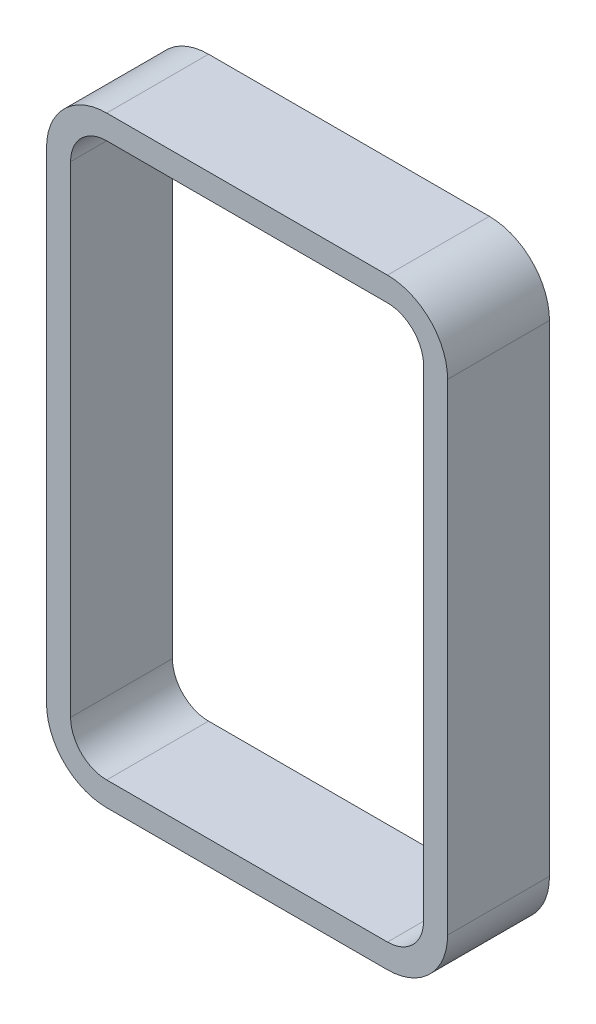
ISO-10303-21;
HEADER;
FILE_DESCRIPTION(('STEP AP214'),'2;1');
FILE_NAME('part.step','',(''),(''),'','','');
FILE_SCHEMA(('AUTOMOTIVE_DESIGN { 1 0 10303 214 1 1 1 1 }'));
ENDSEC;
DATA;
#1=APPLICATION_CONTEXT('core data for automotive mechanical design processes');
#2=APPLICATION_PROTOCOL_DEFINITION('international standard','automotive_design',2000,#1);
#3=PRODUCT_CONTEXT('',#1,'mechanical');
#4=PRODUCT('Part','Part','',(#3));
#5=PRODUCT_RELATED_PRODUCT_CATEGORY('part','',(#4));
#6=PRODUCT_DEFINITION_FORMATION('','',#4);
#7=PRODUCT_DEFINITION_CONTEXT('part definition',#1,'design');
#8=PRODUCT_DEFINITION('design','',#6,#7);
#9=PRODUCT_DEFINITION_SHAPE('','',#8);
#10=(LENGTH_UNIT() NAMED_UNIT(*) SI_UNIT(.MILLI.,.METRE.));
#11=(NAMED_UNIT(*) PLANE_ANGLE_UNIT() SI_UNIT($,.RADIAN.));
#12=(NAMED_UNIT(*) SI_UNIT($,.STERADIAN.) SOLID_ANGLE_UNIT());
#13=UNCERTAINTY_MEASURE_WITH_UNIT(LENGTH_MEASURE(1.E-05),#10,'distance_accuracy_value','');
#14=(GEOMETRIC_REPRESENTATION_CONTEXT(3) GLOBAL_UNCERTAINTY_ASSIGNED_CONTEXT((#13)) GLOBAL_UNIT_ASSIGNED_CONTEXT((#10,
#11,#12)) REPRESENTATION_CONTEXT('',''));
#15=CARTESIAN_POINT('',(0.,0.,0.));
#16=DIRECTION('',(0.,0.,1.));
#17=DIRECTION('',(1.,0.,0.));
#18=AXIS2_PLACEMENT_3D('',#15,#16,#17);
#19=CARTESIAN_POINT('',(-35.,60.,12.7));
#20=DIRECTION('',(0.,0.,-1.));
#21=DIRECTION('',(-1.,0.,0.));
#22=AXIS2_PLACEMENT_3D('',#19,#20,#21);
#23=PLANE('',#22);
#24=CARTESIAN_POINT('',(-35.,60.,12.7));
#25=DIRECTION('',(0.,0.,1.));
#26=DIRECTION('',(-1.,0.,0.));
#27=AXIS2_PLACEMENT_3D('',#24,#25,#26);
#28=CIRCLE('',#27,15.);
#29=CARTESIAN_POINT('',(-35.,75.,12.7));
#30=VERTEX_POINT('',#29);
#31=CARTESIAN_POINT('',(-50.,60.,12.7));
#32=VERTEX_POINT('',#31);
#33=EDGE_CURVE('E220',#30,#32,#28,.T.);
#34=ORIENTED_EDGE('',*,*,#33,.T.);
#35=DIRECTION('',(0.,-1.,0.));
#36=VECTOR('',#35,1.);
#37=CARTESIAN_POINT('',(-50.,-60.,12.7));
#38=LINE('',#37,#36);
#39=CARTESIAN_POINT('',(-50.,-60.,12.7));
#40=VERTEX_POINT('',#39);
#41=EDGE_CURVE('E219',#32,#40,#38,.T.);
#42=ORIENTED_EDGE('',*,*,#41,.T.);
#43=CARTESIAN_POINT('',(-35.,-60.,12.7));
#44=DIRECTION('',(0.,0.,1.));
#45=DIRECTION('',(-1.,0.,0.));
#46=AXIS2_PLACEMENT_3D('',#43,#44,#45);
#47=CIRCLE('',#46,15.);
#48=CARTESIAN_POINT('',(-35.,-75.,12.7));
#49=VERTEX_POINT('',#48);
#50=EDGE_CURVE('E221',#40,#49,#47,.T.);
#51=ORIENTED_EDGE('',*,*,#50,.T.);
#52=DIRECTION('',(1.,0.,0.));
#53=VECTOR('',#52,1.);
#54=CARTESIAN_POINT('',(-35.,-75.,12.7));
#55=LINE('',#54,#53);
#56=CARTESIAN_POINT('',(35.,-75.,12.7));
#57=VERTEX_POINT('',#56);
#58=EDGE_CURVE('E222',#49,#57,#55,.T.);
#59=ORIENTED_EDGE('',*,*,#58,.T.);
#60=CARTESIAN_POINT('',(35.,-60.,12.7));
#61=DIRECTION('',(0.,0.,1.));
#62=DIRECTION('',(1.,0.,0.));
#63=AXIS2_PLACEMENT_3D('',#60,#61,#62);
#64=CIRCLE('',#63,15.);
#65=CARTESIAN_POINT('',(50.,-60.,12.7));
#66=VERTEX_POINT('',#65);
#67=EDGE_CURVE('E227',#57,#66,#64,.T.);
#68=ORIENTED_EDGE('',*,*,#67,.T.);
#69=DIRECTION('',(0.,1.,0.));
#70=VECTOR('',#69,1.);
#71=CARTESIAN_POINT('',(50.,-60.,12.7));
#72=LINE('',#71,#70);
#73=CARTESIAN_POINT('',(50.,60.,12.7));
#74=VERTEX_POINT('',#73);
#75=EDGE_CURVE('E230',#66,#74,#72,.T.);
#76=ORIENTED_EDGE('',*,*,#75,.T.);
#77=CARTESIAN_POINT('',(35.,60.,12.7));
#78=DIRECTION('',(0.,0.,1.));
#79=DIRECTION('',(-1.,0.,0.));
#80=AXIS2_PLACEMENT_3D('',#77,#78,#79);
#81=CIRCLE('',#80,15.);
#82=CARTESIAN_POINT('',(35.,75.,12.7));
#83=VERTEX_POINT('',#82);
#84=EDGE_CURVE('E233',#74,#83,#81,.T.);
#85=ORIENTED_EDGE('',*,*,#84,.T.);
#86=DIRECTION('',(-1.,0.,0.));
#87=VECTOR('',#86,1.);
#88=CARTESIAN_POINT('',(-35.,75.,12.7));
#89=LINE('',#88,#87);
#90=EDGE_CURVE('E231',#83,#30,#89,.T.);
#91=ORIENTED_EDGE('',*,*,#90,.T.);
#92=EDGE_LOOP('',(#34,#42,#51,#59,#68,#76,#85,#91));
#93=FACE_BOUND('',#92,.T.);
#94=CARTESIAN_POINT('',(-35.,60.,12.7));
#95=DIRECTION('',(0.,0.,1.));
#96=DIRECTION('',(-1.,0.,0.));
#97=AXIS2_PLACEMENT_3D('',#94,#95,#96);
#98=CIRCLE('',#97,9.);
#99=CARTESIAN_POINT('',(-35.,69.,12.7));
#100=VERTEX_POINT('',#99);
#101=CARTESIAN_POINT('',(-44.,60.,12.7));
#102=VERTEX_POINT('',#101);
#103=EDGE_CURVE('E155',#100,#102,#98,.T.);
#104=ORIENTED_EDGE('',*,*,#103,.F.);
#105=DIRECTION('',(-1.,0.,0.));
#106=VECTOR('',#105,1.);
#107=CARTESIAN_POINT('',(-35.,69.,12.7));
#108=LINE('',#107,#106);
#109=CARTESIAN_POINT('',(35.,69.,12.7));
#110=VERTEX_POINT('',#109);
#111=EDGE_CURVE('E184',#110,#100,#108,.T.);
#112=ORIENTED_EDGE('',*,*,#111,.F.);
#113=CARTESIAN_POINT('',(35.,60.,12.7));
#114=DIRECTION('',(0.,0.,1.));
#115=DIRECTION('',(-1.,0.,0.));
#116=AXIS2_PLACEMENT_3D('',#113,#114,#115);
#117=CIRCLE('',#116,9.);
#118=CARTESIAN_POINT('',(44.,60.,12.7));
#119=VERTEX_POINT('',#118);
#120=EDGE_CURVE('E182',#119,#110,#117,.T.);
#121=ORIENTED_EDGE('',*,*,#120,.F.);
#122=DIRECTION('',(0.,1.,0.));
#123=VECTOR('',#122,1.);
#124=CARTESIAN_POINT('',(44.,-60.,12.7));
#125=LINE('',#124,#123);
#126=CARTESIAN_POINT('',(44.,-60.,12.7));
#127=VERTEX_POINT('',#126);
#128=EDGE_CURVE('E181',#127,#119,#125,.T.);
#129=ORIENTED_EDGE('',*,*,#128,.F.);
#130=CARTESIAN_POINT('',(35.,-60.,12.7));
#131=DIRECTION('',(0.,0.,1.));
#132=DIRECTION('',(1.,0.,0.));
#133=AXIS2_PLACEMENT_3D('',#130,#131,#132);
#134=CIRCLE('',#133,8.99999999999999);
#135=CARTESIAN_POINT('',(35.,-69.,12.7));
#136=VERTEX_POINT('',#135);
#137=EDGE_CURVE('E177',#136,#127,#134,.T.);
#138=ORIENTED_EDGE('',*,*,#137,.F.);
#139=DIRECTION('',(1.,0.,0.));
#140=VECTOR('',#139,1.);
#141=CARTESIAN_POINT('',(-35.,-69.,12.7));
#142=LINE('',#141,#140);
#143=CARTESIAN_POINT('',(-35.,-69.,12.7));
#144=VERTEX_POINT('',#143);
#145=EDGE_CURVE('E174',#144,#136,#142,.T.);
#146=ORIENTED_EDGE('',*,*,#145,.F.);
#147=CARTESIAN_POINT('',(-35.,-60.,12.7));
#148=DIRECTION('',(0.,0.,1.));
#149=DIRECTION('',(-1.,0.,0.));
#150=AXIS2_PLACEMENT_3D('',#147,#148,#149);
#151=CIRCLE('',#150,9.);
#152=CARTESIAN_POINT('',(-44.,-60.,12.7));
#153=VERTEX_POINT('',#152);
#154=EDGE_CURVE('E173',#153,#144,#151,.T.);
#155=ORIENTED_EDGE('',*,*,#154,.F.);
#156=DIRECTION('',(0.,-1.,0.));
#157=VECTOR('',#156,1.);
#158=CARTESIAN_POINT('',(-44.,-60.,12.7));
#159=LINE('',#158,#157);
#160=EDGE_CURVE('E157',#102,#153,#159,.T.);
#161=ORIENTED_EDGE('',*,*,#160,.F.);
#162=EDGE_LOOP('',(#104,#112,#121,#129,#138,#146,#155,#161));
#163=FACE_BOUND('',#162,.T.);
#164=ADVANCED_FACE('F39',(#93,#163),#23,.F.);
#165=CARTESIAN_POINT('',(-35.,60.,-12.7));
#166=DIRECTION('',(0.,0.,-1.));
#167=DIRECTION('',(-1.,0.,0.));
#168=AXIS2_PLACEMENT_3D('',#165,#166,#167);
#169=PLANE('',#168);
#170=CARTESIAN_POINT('',(-35.,60.,-12.7));
#171=DIRECTION('',(0.,0.,1.));
#172=DIRECTION('',(-1.,0.,0.));
#173=AXIS2_PLACEMENT_3D('',#170,#171,#172);
#174=CIRCLE('',#173,15.);
#175=CARTESIAN_POINT('',(-35.,75.,-12.7));
#176=VERTEX_POINT('',#175);
#177=CARTESIAN_POINT('',(-50.,60.,-12.7));
#178=VERTEX_POINT('',#177);
#179=EDGE_CURVE('E166',#176,#178,#174,.T.);
#180=ORIENTED_EDGE('',*,*,#179,.F.);
#181=DIRECTION('',(-1.,0.,0.));
#182=VECTOR('',#181,1.);
#183=CARTESIAN_POINT('',(-35.,75.,-12.7));
#184=LINE('',#183,#182);
#185=CARTESIAN_POINT('',(35.,75.,-12.7));
#186=VERTEX_POINT('',#185);
#187=EDGE_CURVE('E223',#186,#176,#184,.T.);
#188=ORIENTED_EDGE('',*,*,#187,.F.);
#189=CARTESIAN_POINT('',(35.,60.,-12.7));
#190=DIRECTION('',(0.,0.,1.));
#191=DIRECTION('',(-1.,0.,0.));
#192=AXIS2_PLACEMENT_3D('',#189,#190,#191);
#193=CIRCLE('',#192,15.);
#194=CARTESIAN_POINT('',(50.,60.,-12.7));
#195=VERTEX_POINT('',#194);
#196=EDGE_CURVE('E247',#195,#186,#193,.T.);
#197=ORIENTED_EDGE('',*,*,#196,.F.);
#198=DIRECTION('',(0.,1.,0.));
#199=VECTOR('',#198,1.);
#200=CARTESIAN_POINT('',(50.,-60.,-12.7));
#201=LINE('',#200,#199);
#202=CARTESIAN_POINT('',(50.,-60.,-12.7));
#203=VERTEX_POINT('',#202);
#204=EDGE_CURVE('E246',#203,#195,#201,.T.);
#205=ORIENTED_EDGE('',*,*,#204,.F.);
#206=CARTESIAN_POINT('',(35.,-60.,-12.7));
#207=DIRECTION('',(0.,0.,1.));
#208=DIRECTION('',(1.,0.,0.));
#209=AXIS2_PLACEMENT_3D('',#206,#207,#208);
#210=CIRCLE('',#209,15.);
#211=CARTESIAN_POINT('',(35.,-75.,-12.7));
#212=VERTEX_POINT('',#211);
#213=EDGE_CURVE('E242',#212,#203,#210,.T.);
#214=ORIENTED_EDGE('',*,*,#213,.F.);
#215=DIRECTION('',(1.,0.,0.));
#216=VECTOR('',#215,1.);
#217=CARTESIAN_POINT('',(-35.,-75.,-12.7));
#218=LINE('',#217,#216);
#219=CARTESIAN_POINT('',(-35.,-75.,-12.7));
#220=VERTEX_POINT('',#219);
#221=EDGE_CURVE('E245',#220,#212,#218,.T.);
#222=ORIENTED_EDGE('',*,*,#221,.F.);
#223=CARTESIAN_POINT('',(-35.,-60.,-12.7));
#224=DIRECTION('',(0.,0.,1.));
#225=DIRECTION('',(-1.,0.,0.));
#226=AXIS2_PLACEMENT_3D('',#223,#224,#225);
#227=CIRCLE('',#226,15.);
#228=CARTESIAN_POINT('',(-50.,-60.,-12.7));
#229=VERTEX_POINT('',#228);
#230=EDGE_CURVE('E239',#229,#220,#227,.T.);
#231=ORIENTED_EDGE('',*,*,#230,.F.);
#232=DIRECTION('',(0.,-1.,0.));
#233=VECTOR('',#232,1.);
#234=CARTESIAN_POINT('',(-50.,-60.,-12.7));
#235=LINE('',#234,#233);
#236=EDGE_CURVE('E238',#178,#229,#235,.T.);
#237=ORIENTED_EDGE('',*,*,#236,.F.);
#238=EDGE_LOOP('',(#180,#188,#197,#205,#214,#222,#231,#237));
#239=FACE_BOUND('',#238,.T.);
#240=DIRECTION('',(-1.,0.,0.));
#241=VECTOR('',#240,1.);
#242=CARTESIAN_POINT('',(-35.,69.,-12.7));
#243=LINE('',#242,#241);
#244=CARTESIAN_POINT('',(35.,69.,-12.7));
#245=VERTEX_POINT('',#244);
#246=CARTESIAN_POINT('',(-35.,69.,-12.7));
#247=VERTEX_POINT('',#246);
#248=EDGE_CURVE('E163',#245,#247,#243,.T.);
#249=ORIENTED_EDGE('',*,*,#248,.T.);
#250=CARTESIAN_POINT('',(-35.,60.,-12.7));
#251=DIRECTION('',(0.,0.,1.));
#252=DIRECTION('',(-1.,0.,0.));
#253=AXIS2_PLACEMENT_3D('',#250,#251,#252);
#254=CIRCLE('',#253,9.);
#255=CARTESIAN_POINT('',(-44.,60.,-12.7));
#256=VERTEX_POINT('',#255);
#257=EDGE_CURVE('E65',#247,#256,#254,.T.);
#258=ORIENTED_EDGE('',*,*,#257,.T.);
#259=DIRECTION('',(0.,-1.,0.));
#260=VECTOR('',#259,1.);
#261=CARTESIAN_POINT('',(-44.,-60.,-12.7));
#262=LINE('',#261,#260);
#263=CARTESIAN_POINT('',(-44.,-60.,-12.7));
#264=VERTEX_POINT('',#263);
#265=EDGE_CURVE('E170',#256,#264,#262,.T.);
#266=ORIENTED_EDGE('',*,*,#265,.T.);
#267=CARTESIAN_POINT('',(-35.,-60.,-12.7));
#268=DIRECTION('',(0.,0.,1.));
#269=DIRECTION('',(-1.,0.,0.));
#270=AXIS2_PLACEMENT_3D('',#267,#268,#269);
#271=CIRCLE('',#270,9.);
#272=CARTESIAN_POINT('',(-35.,-69.,-12.7));
#273=VERTEX_POINT('',#272);
#274=EDGE_CURVE('E186',#264,#273,#271,.T.);
#275=ORIENTED_EDGE('',*,*,#274,.T.);
#276=DIRECTION('',(1.,0.,0.));
#277=VECTOR('',#276,1.);
#278=CARTESIAN_POINT('',(-35.,-69.,-12.7));
#279=LINE('',#278,#277);
#280=CARTESIAN_POINT('',(35.,-69.,-12.7));
#281=VERTEX_POINT('',#280);
#282=EDGE_CURVE('E195',#273,#281,#279,.T.);
#283=ORIENTED_EDGE('',*,*,#282,.T.);
#284=CARTESIAN_POINT('',(35.,-60.,-12.7));
#285=DIRECTION('',(0.,0.,1.));
#286=DIRECTION('',(1.,0.,0.));
#287=AXIS2_PLACEMENT_3D('',#284,#285,#286);
#288=CIRCLE('',#287,8.99999999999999);
#289=CARTESIAN_POINT('',(44.,-60.,-12.7));
#290=VERTEX_POINT('',#289);
#291=EDGE_CURVE('E193',#281,#290,#288,.T.);
#292=ORIENTED_EDGE('',*,*,#291,.T.);
#293=DIRECTION('',(0.,1.,0.));
#294=VECTOR('',#293,1.);
#295=CARTESIAN_POINT('',(44.,-60.,-12.7));
#296=LINE('',#295,#294);
#297=CARTESIAN_POINT('',(44.,60.,-12.7));
#298=VERTEX_POINT('',#297);
#299=EDGE_CURVE('E196',#290,#298,#296,.T.);
#300=ORIENTED_EDGE('',*,*,#299,.T.);
#301=CARTESIAN_POINT('',(35.,60.,-12.7));
#302=DIRECTION('',(0.,0.,1.));
#303=DIRECTION('',(-1.,0.,0.));
#304=AXIS2_PLACEMENT_3D('',#301,#302,#303);
#305=CIRCLE('',#304,9.);
#306=EDGE_CURVE('E203',#298,#245,#305,.T.);
#307=ORIENTED_EDGE('',*,*,#306,.T.);
#308=EDGE_LOOP('',(#249,#258,#266,#275,#283,#292,#300,#307));
#309=FACE_BOUND('',#308,.T.);
#310=ADVANCED_FACE('F279',(#239,#309),#169,.T.);
#311=CARTESIAN_POINT('',(-35.,60.,12.7));
#312=DIRECTION('',(0.,0.,-1.));
#313=DIRECTION('',(-1.,0.,0.));
#314=AXIS2_PLACEMENT_3D('',#311,#312,#313);
#315=CYLINDRICAL_SURFACE('',#314,15.);
#316=ORIENTED_EDGE('',*,*,#179,.T.);
#317=DIRECTION('',(0.,0.,-1.));
#318=VECTOR('',#317,1.);
#319=CARTESIAN_POINT('',(-50.,60.,12.7));
#320=LINE('',#319,#318);
#321=EDGE_CURVE('E11',#32,#178,#320,.T.);
#322=ORIENTED_EDGE('',*,*,#321,.F.);
#323=ORIENTED_EDGE('',*,*,#33,.F.);
#324=DIRECTION('',(0.,0.,-1.));
#325=VECTOR('',#324,1.);
#326=CARTESIAN_POINT('',(-35.,75.,12.7));
#327=LINE('',#326,#325);
#328=EDGE_CURVE('E232',#30,#176,#327,.T.);
#329=ORIENTED_EDGE('',*,*,#328,.T.);
#330=EDGE_LOOP('',(#316,#322,#323,#329));
#331=FACE_BOUND('',#330,.T.);
#332=ADVANCED_FACE('F41',(#331),#315,.T.);
#333=CARTESIAN_POINT('',(-50.,-60.,12.7));
#334=DIRECTION('',(1.,0.,0.));
#335=DIRECTION('',(0.,0.,-1.));
#336=AXIS2_PLACEMENT_3D('',#333,#334,#335);
#337=PLANE('',#336);
#338=ORIENTED_EDGE('',*,*,#236,.T.);
#339=DIRECTION('',(0.,0.,-1.));
#340=VECTOR('',#339,1.);
#341=CARTESIAN_POINT('',(-50.,-60.,12.7));
#342=LINE('',#341,#340);
#343=EDGE_CURVE('E50',#40,#229,#342,.T.);
#344=ORIENTED_EDGE('',*,*,#343,.F.);
#345=ORIENTED_EDGE('',*,*,#41,.F.);
#346=ORIENTED_EDGE('',*,*,#321,.T.);
#347=EDGE_LOOP('',(#338,#344,#345,#346));
#348=FACE_BOUND('',#347,.T.);
#349=ADVANCED_FACE('F294',(#348),#337,.F.);
#350=CARTESIAN_POINT('',(-35.,-60.,12.7));
#351=DIRECTION('',(0.,0.,-1.));
#352=DIRECTION('',(-1.,0.,0.));
#353=AXIS2_PLACEMENT_3D('',#350,#351,#352);
#354=CYLINDRICAL_SURFACE('',#353,15.);
#355=ORIENTED_EDGE('',*,*,#230,.T.);
#356=DIRECTION('',(0.,0.,-1.));
#357=VECTOR('',#356,1.);
#358=CARTESIAN_POINT('',(-35.,-75.,12.7));
#359=LINE('',#358,#357);
#360=EDGE_CURVE('E264',#49,#220,#359,.T.);
#361=ORIENTED_EDGE('',*,*,#360,.F.);
#362=ORIENTED_EDGE('',*,*,#50,.F.);
#363=ORIENTED_EDGE('',*,*,#343,.T.);
#364=EDGE_LOOP('',(#355,#361,#362,#363));
#365=FACE_BOUND('',#364,.T.);
#366=ADVANCED_FACE('F275',(#365),#354,.T.);
#367=CARTESIAN_POINT('',(-35.,-75.,12.7));
#368=DIRECTION('',(0.,1.,0.));
#369=DIRECTION('',(0.,0.,1.));
#370=AXIS2_PLACEMENT_3D('',#367,#368,#369);
#371=PLANE('',#370);
#372=ORIENTED_EDGE('',*,*,#221,.T.);
#373=DIRECTION('',(0.,0.,-1.));
#374=VECTOR('',#373,1.);
#375=CARTESIAN_POINT('',(35.,-75.,12.7));
#376=LINE('',#375,#374);
#377=EDGE_CURVE('E265',#57,#212,#376,.T.);
#378=ORIENTED_EDGE('',*,*,#377,.F.);
#379=ORIENTED_EDGE('',*,*,#58,.F.);
#380=ORIENTED_EDGE('',*,*,#360,.T.);
#381=EDGE_LOOP('',(#372,#378,#379,#380));
#382=FACE_BOUND('',#381,.T.);
#383=ADVANCED_FACE('F282',(#382),#371,.F.);
#384=CARTESIAN_POINT('',(35.,-60.,12.7));
#385=DIRECTION('',(0.,0.,-1.));
#386=DIRECTION('',(-1.,0.,0.));
#387=AXIS2_PLACEMENT_3D('',#384,#385,#386);
#388=CYLINDRICAL_SURFACE('',#387,15.);
#389=ORIENTED_EDGE('',*,*,#213,.T.);
#390=DIRECTION('',(0.,0.,-1.));
#391=VECTOR('',#390,1.);
#392=CARTESIAN_POINT('',(50.,-60.,12.7));
#393=LINE('',#392,#391);
#394=EDGE_CURVE('E256',#66,#203,#393,.T.);
#395=ORIENTED_EDGE('',*,*,#394,.F.);
#396=ORIENTED_EDGE('',*,*,#67,.F.);
#397=ORIENTED_EDGE('',*,*,#377,.T.);
#398=EDGE_LOOP('',(#389,#395,#396,#397));
#399=FACE_BOUND('',#398,.T.);
#400=ADVANCED_FACE('F286',(#399),#388,.T.);
#401=CARTESIAN_POINT('',(50.,-60.,12.7));
#402=DIRECTION('',(-1.,0.,0.));
#403=DIRECTION('',(0.,0.,1.));
#404=AXIS2_PLACEMENT_3D('',#401,#402,#403);
#405=PLANE('',#404);
#406=ORIENTED_EDGE('',*,*,#204,.T.);
#407=DIRECTION('',(0.,0.,-1.));
#408=VECTOR('',#407,1.);
#409=CARTESIAN_POINT('',(50.,60.,12.7));
#410=LINE('',#409,#408);
#411=EDGE_CURVE('E257',#74,#195,#410,.T.);
#412=ORIENTED_EDGE('',*,*,#411,.F.);
#413=ORIENTED_EDGE('',*,*,#75,.F.);
#414=ORIENTED_EDGE('',*,*,#394,.T.);
#415=EDGE_LOOP('',(#406,#412,#413,#414));
#416=FACE_BOUND('',#415,.T.);
#417=ADVANCED_FACE('F308',(#416),#405,.F.);
#418=CARTESIAN_POINT('',(35.,60.,12.7));
#419=DIRECTION('',(0.,0.,-1.));
#420=DIRECTION('',(-1.,0.,0.));
#421=AXIS2_PLACEMENT_3D('',#418,#419,#420);
#422=CYLINDRICAL_SURFACE('',#421,15.);
#423=ORIENTED_EDGE('',*,*,#196,.T.);
#424=DIRECTION('',(0.,0.,-1.));
#425=VECTOR('',#424,1.);
#426=CARTESIAN_POINT('',(35.,75.,12.7));
#427=LINE('',#426,#425);
#428=EDGE_CURVE('E254',#83,#186,#427,.T.);
#429=ORIENTED_EDGE('',*,*,#428,.F.);
#430=ORIENTED_EDGE('',*,*,#84,.F.);
#431=ORIENTED_EDGE('',*,*,#411,.T.);
#432=EDGE_LOOP('',(#423,#429,#430,#431));
#433=FACE_BOUND('',#432,.T.);
#434=ADVANCED_FACE('F306',(#433),#422,.T.);
#435=CARTESIAN_POINT('',(-35.,75.,12.7));
#436=DIRECTION('',(0.,-1.,0.));
#437=DIRECTION('',(0.,0.,-1.));
#438=AXIS2_PLACEMENT_3D('',#435,#436,#437);
#439=PLANE('',#438);
#440=ORIENTED_EDGE('',*,*,#187,.T.);
#441=ORIENTED_EDGE('',*,*,#328,.F.);
#442=ORIENTED_EDGE('',*,*,#90,.F.);
#443=ORIENTED_EDGE('',*,*,#428,.T.);
#444=EDGE_LOOP('',(#440,#441,#442,#443));
#445=FACE_BOUND('',#444,.T.);
#446=ADVANCED_FACE('F301',(#445),#439,.F.);
#447=CARTESIAN_POINT('',(-35.,60.,12.7));
#448=DIRECTION('',(0.,0.,-1.));
#449=DIRECTION('',(-1.,0.,0.));
#450=AXIS2_PLACEMENT_3D('',#447,#448,#449);
#451=CYLINDRICAL_SURFACE('',#450,9.);
#452=ORIENTED_EDGE('',*,*,#257,.F.);
#453=DIRECTION('',(0.,0.,-1.));
#454=VECTOR('',#453,1.);
#455=CARTESIAN_POINT('',(-35.,69.,12.7));
#456=LINE('',#455,#454);
#457=EDGE_CURVE('E158',#100,#247,#456,.T.);
#458=ORIENTED_EDGE('',*,*,#457,.F.);
#459=ORIENTED_EDGE('',*,*,#103,.T.);
#460=DIRECTION('',(0.,0.,-1.));
#461=VECTOR('',#460,1.);
#462=CARTESIAN_POINT('',(-44.,60.,12.7));
#463=LINE('',#462,#461);
#464=EDGE_CURVE('E154',#102,#256,#463,.T.);
#465=ORIENTED_EDGE('',*,*,#464,.T.);
#466=EDGE_LOOP('',(#452,#458,#459,#465));
#467=FACE_BOUND('',#466,.T.);
#468=ADVANCED_FACE('F152',(#467),#451,.F.);
#469=CARTESIAN_POINT('',(-44.,-60.,12.7));
#470=DIRECTION('',(1.,0.,0.));
#471=DIRECTION('',(0.,0.,-1.));
#472=AXIS2_PLACEMENT_3D('',#469,#470,#471);
#473=PLANE('',#472);
#474=ORIENTED_EDGE('',*,*,#265,.F.);
#475=ORIENTED_EDGE('',*,*,#464,.F.);
#476=ORIENTED_EDGE('',*,*,#160,.T.);
#477=DIRECTION('',(0.,0.,-1.));
#478=VECTOR('',#477,1.);
#479=CARTESIAN_POINT('',(-44.,-60.,12.7));
#480=LINE('',#479,#478);
#481=EDGE_CURVE('E169',#153,#264,#480,.T.);
#482=ORIENTED_EDGE('',*,*,#481,.T.);
#483=EDGE_LOOP('',(#474,#475,#476,#482));
#484=FACE_BOUND('',#483,.T.);
#485=ADVANCED_FACE('F165',(#484),#473,.T.);
#486=CARTESIAN_POINT('',(-35.,-60.,12.7));
#487=DIRECTION('',(0.,0.,-1.));
#488=DIRECTION('',(-1.,0.,0.));
#489=AXIS2_PLACEMENT_3D('',#486,#487,#488);
#490=CYLINDRICAL_SURFACE('',#489,9.);
#491=ORIENTED_EDGE('',*,*,#274,.F.);
#492=ORIENTED_EDGE('',*,*,#481,.F.);
#493=ORIENTED_EDGE('',*,*,#154,.T.);
#494=DIRECTION('',(0.,0.,-1.));
#495=VECTOR('',#494,1.);
#496=CARTESIAN_POINT('',(-35.,-69.,12.7));
#497=LINE('',#496,#495);
#498=EDGE_CURVE('E211',#144,#273,#497,.T.);
#499=ORIENTED_EDGE('',*,*,#498,.T.);
#500=EDGE_LOOP('',(#491,#492,#493,#499));
#501=FACE_BOUND('',#500,.T.);
#502=ADVANCED_FACE('F331',(#501),#490,.F.);
#503=CARTESIAN_POINT('',(-35.,-69.,12.7));
#504=DIRECTION('',(0.,1.,0.));
#505=DIRECTION('',(0.,0.,1.));
#506=AXIS2_PLACEMENT_3D('',#503,#504,#505);
#507=PLANE('',#506);
#508=ORIENTED_EDGE('',*,*,#282,.F.);
#509=ORIENTED_EDGE('',*,*,#498,.F.);
#510=ORIENTED_EDGE('',*,*,#145,.T.);
#511=DIRECTION('',(0.,0.,-1.));
#512=VECTOR('',#511,1.);
#513=CARTESIAN_POINT('',(35.,-69.,12.7));
#514=LINE('',#513,#512);
#515=EDGE_CURVE('E215',#136,#281,#514,.T.);
#516=ORIENTED_EDGE('',*,*,#515,.T.);
#517=EDGE_LOOP('',(#508,#509,#510,#516));
#518=FACE_BOUND('',#517,.T.);
#519=ADVANCED_FACE('F340',(#518),#507,.T.);
#520=CARTESIAN_POINT('',(35.,-60.,12.7));
#521=DIRECTION('',(0.,0.,-1.));
#522=DIRECTION('',(-1.,0.,0.));
#523=AXIS2_PLACEMENT_3D('',#520,#521,#522);
#524=CYLINDRICAL_SURFACE('',#523,8.99999999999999);
#525=ORIENTED_EDGE('',*,*,#291,.F.);
#526=ORIENTED_EDGE('',*,*,#515,.F.);
#527=ORIENTED_EDGE('',*,*,#137,.T.);
#528=DIRECTION('',(0.,0.,-1.));
#529=VECTOR('',#528,1.);
#530=CARTESIAN_POINT('',(44.,-60.,12.7));
#531=LINE('',#530,#529);
#532=EDGE_CURVE('E208',#127,#290,#531,.T.);
#533=ORIENTED_EDGE('',*,*,#532,.T.);
#534=EDGE_LOOP('',(#525,#526,#527,#533));
#535=FACE_BOUND('',#534,.T.);
#536=ADVANCED_FACE('F344',(#535),#524,.F.);
#537=CARTESIAN_POINT('',(44.,-60.,12.7));
#538=DIRECTION('',(-1.,0.,0.));
#539=DIRECTION('',(0.,-1.,0.));
#540=AXIS2_PLACEMENT_3D('',#537,#538,#539);
#541=PLANE('',#540);
#542=ORIENTED_EDGE('',*,*,#299,.F.);
#543=ORIENTED_EDGE('',*,*,#532,.F.);
#544=ORIENTED_EDGE('',*,*,#128,.T.);
#545=DIRECTION('',(0.,0.,-1.));
#546=VECTOR('',#545,1.);
#547=CARTESIAN_POINT('',(44.,60.,12.7));
#548=LINE('',#547,#546);
#549=EDGE_CURVE('E206',#119,#298,#548,.T.);
#550=ORIENTED_EDGE('',*,*,#549,.T.);
#551=EDGE_LOOP('',(#542,#543,#544,#550));
#552=FACE_BOUND('',#551,.T.);
#553=ADVANCED_FACE('F350',(#552),#541,.T.);
#554=CARTESIAN_POINT('',(35.,60.,12.7));
#555=DIRECTION('',(0.,0.,-1.));
#556=DIRECTION('',(-1.,0.,0.));
#557=AXIS2_PLACEMENT_3D('',#554,#555,#556);
#558=CYLINDRICAL_SURFACE('',#557,9.);
#559=ORIENTED_EDGE('',*,*,#306,.F.);
#560=ORIENTED_EDGE('',*,*,#549,.F.);
#561=ORIENTED_EDGE('',*,*,#120,.T.);
#562=DIRECTION('',(0.,0.,-1.));
#563=VECTOR('',#562,1.);
#564=CARTESIAN_POINT('',(35.,69.,12.7));
#565=LINE('',#564,#563);
#566=EDGE_CURVE('E53',#110,#245,#565,.T.);
#567=ORIENTED_EDGE('',*,*,#566,.T.);
#568=EDGE_LOOP('',(#559,#560,#561,#567));
#569=FACE_BOUND('',#568,.T.);
#570=ADVANCED_FACE('F353',(#569),#558,.F.);
#571=CARTESIAN_POINT('',(-35.,69.,12.7));
#572=DIRECTION('',(0.,-1.,0.));
#573=DIRECTION('',(0.,0.,-1.));
#574=AXIS2_PLACEMENT_3D('',#571,#572,#573);
#575=PLANE('',#574);
#576=ORIENTED_EDGE('',*,*,#248,.F.);
#577=ORIENTED_EDGE('',*,*,#566,.F.);
#578=ORIENTED_EDGE('',*,*,#111,.T.);
#579=ORIENTED_EDGE('',*,*,#457,.T.);
#580=EDGE_LOOP('',(#576,#577,#578,#579));
#581=FACE_BOUND('',#580,.T.);
#582=ADVANCED_FACE('F352',(#581),#575,.T.);
#583=CLOSED_SHELL('',(#164,#310,#332,#349,#366,#383,#400,#417,#434,#446,#468,#485,#502,#519,
#536,#553,#570,#582));
#584=MANIFOLD_SOLID_BREP('B2',#583);
#585=ADVANCED_BREP_SHAPE_REPRESENTATION('',(#18,#584),#14);
#586=SHAPE_DEFINITION_REPRESENTATION(#9,#585);
ENDSEC;
END-ISO-10303-21;
